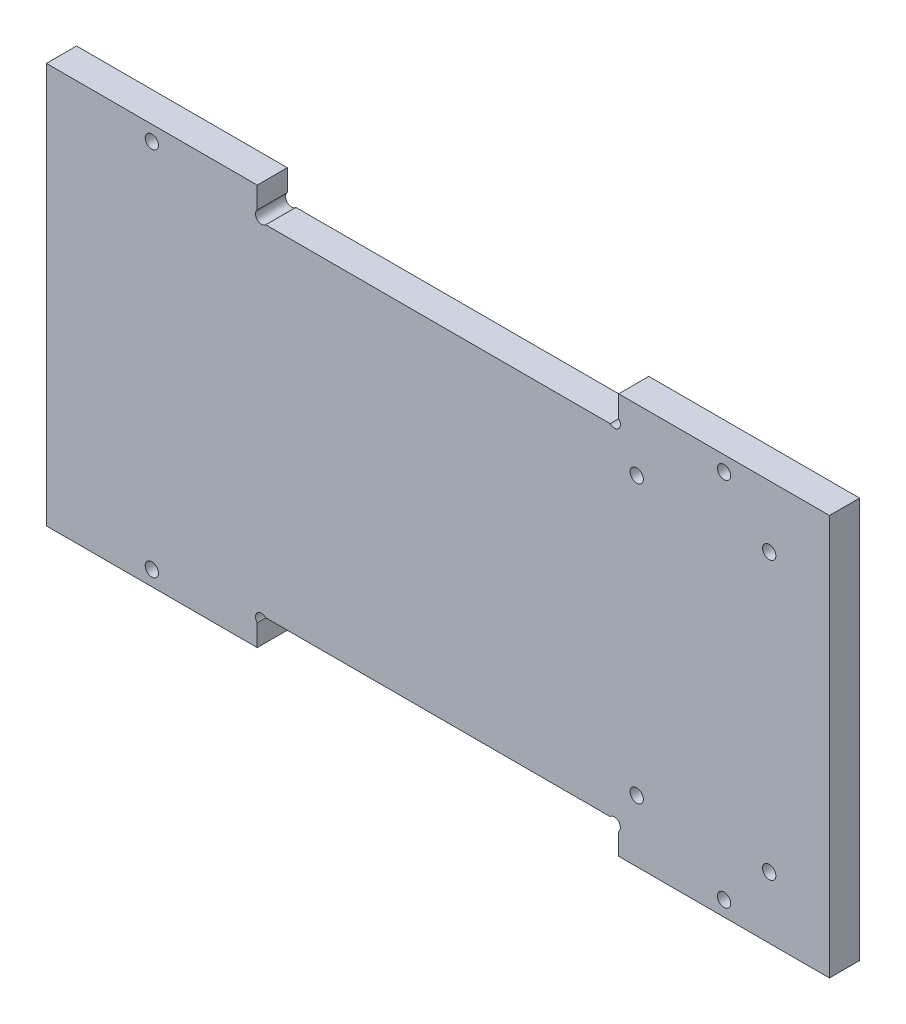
from build123d import *

# Parameters (mm, degrees)
ESQUISSE1_W               = 130
ESQUISSE1_H               = 66.5
BOSS_EXTRU_1_DEPTH        = 5
ENL_V_MAT_EXTRU_2_REACH   = 148.107
ESQUISSE3_R               = 1.1
ENL_V_MAT_EXTRU_4_REACH   = 148.107
ESQUISSE6_W               = 60
ESQUISSE6_H               = 5
ENL_V_START               = -5
ESQUISSE7_R               = 1
ENL_V_MAT_EXTRU_5_DEPTH   = 5
ENL_V_MAT_EXTRU_6_REACH   = 148.107
ESQUISSE8_R               = 1.1
SYM_TRIE3_COPY_1_REACH    = 148.107
SYM_TRIE3_COPY_1_SKETCH_R = 1.1


with BuildPart() as part:
    # Esquisse1 → Boss.-Extru.1 (new body)
    with BuildSketch(Plane.XY):
        with Locations((65, 33.25)):
            Rectangle(ESQUISSE1_W, ESQUISSE1_H)
    extrude(amount=BOSS_EXTRU_1_DEPTH)

    # Esquisse3 → Enl_v. mat.-Extru.2 (cut, up to next)
    with BuildSketch(Plane.XY.offset(5), mode=Mode.PRIVATE) as enl_v_mat_extru_2_sk1:
        with Locations((120, 56.25)):
            Circle(ESQUISSE3_R)
    enl_v_mat_extru_2_tool1 = extrude(enl_v_mat_extru_2_sk1.sketch, amount=-ENL_V_MAT_EXTRU_2_REACH, mode=Mode.PRIVATE) & part.part
    # Esquisse3 → Enl_v. mat.-Extru.2 (cut, up to next)
    with BuildSketch(Plane.XY.offset(5), mode=Mode.PRIVATE) as enl_v_mat_extru_2_sk2:
        with Locations((120, 10.25)):
            Circle(ESQUISSE3_R)
    enl_v_mat_extru_2_tool2 = extrude(enl_v_mat_extru_2_sk2.sketch, amount=-ENL_V_MAT_EXTRU_2_REACH, mode=Mode.PRIVATE) & part.part
    # Esquisse3 → Enl_v. mat.-Extru.2 (cut, up to next)
    with BuildSketch(Plane.XY.offset(5), mode=Mode.PRIVATE) as enl_v_mat_extru_2_sk3:
        with Locations((98, 10.25)):
            Circle(ESQUISSE3_R)
    enl_v_mat_extru_2_tool3 = extrude(enl_v_mat_extru_2_sk3.sketch, amount=-ENL_V_MAT_EXTRU_2_REACH, mode=Mode.PRIVATE) & part.part
    # Esquisse3 → Enl_v. mat.-Extru.2 (cut, up to next)
    with BuildSketch(Plane.XY.offset(5), mode=Mode.PRIVATE) as enl_v_mat_extru_2_sk4:
        with Locations((98, 56.25)):
            Circle(ESQUISSE3_R)
    enl_v_mat_extru_2_tool4 = extrude(enl_v_mat_extru_2_sk4.sketch, amount=-ENL_V_MAT_EXTRU_2_REACH, mode=Mode.PRIVATE) & part.part
    add(enl_v_mat_extru_2_tool1.solids().sort_by_distance((120, 56.25, 5))[0], mode=Mode.SUBTRACT)
    add(enl_v_mat_extru_2_tool2.solids().sort_by_distance((120, 10.25, 5))[0], mode=Mode.SUBTRACT)
    add(enl_v_mat_extru_2_tool3.solids().sort_by_distance((98, 10.25, 5))[0], mode=Mode.SUBTRACT)
    add(enl_v_mat_extru_2_tool4.solids().sort_by_distance((98, 56.25, 5))[0], mode=Mode.SUBTRACT)

    # Esquisse6 → Enl_v. mat.-Extru.4 (cut, up to next)
    with BuildSketch(Plane(origin=(0, 0, 0), x_dir=(-1, 0, 0), z_dir=(0, 0, -1)), mode=Mode.PRIVATE) as enl_v_mat_extru_4_sk1:
        with Locations((-65, 2.5)):
            Rectangle(ESQUISSE6_W, ESQUISSE6_H)
    enl_v_mat_extru_4_tool1 = extrude(enl_v_mat_extru_4_sk1.sketch, amount=-ENL_V_MAT_EXTRU_4_REACH, mode=Mode.PRIVATE) & part.part
    enl_v_mat_extru_4 = enl_v_mat_extru_4_tool1.solids().sort_by_distance((65, 2.5, 0))[0]
    add(enl_v_mat_extru_4, mode=Mode.SUBTRACT)

    # Esquisse7 → Enl_v. mat.-Extru.5 (cut)
    with BuildSketch(Plane(origin=(0, 0, 0), x_dir=(-1, 0, 0), z_dir=(0, 0, -1)).offset(ENL_V_START)):
        with Locations((-94.292893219, 4.292893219)):
            Circle(ESQUISSE7_R)
        with Locations((-35.707106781, 4.292893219)):
            Circle(ESQUISSE7_R)
    enl_v_mat_extru_5 = extrude(amount=ENL_V_MAT_EXTRU_5_DEPTH, mode=Mode.SUBTRACT)

    # Sym_trie1: Enl_v. mat.-Extru.4, Enl_v. mat.-Extru.5 across plane
    add(enl_v_mat_extru_4.mirror(Plane(origin=(0, 33.25, 0), x_dir=(0, 0, 1), z_dir=(0, -1, 0))), mode=Mode.SUBTRACT)
    add(enl_v_mat_extru_5.mirror(Plane(origin=(0, 33.25, 0), x_dir=(0, 0, 1), z_dir=(0, -1, 0))), mode=Mode.SUBTRACT)

    # Esquisse8 → Enl_v. mat.-Extru.6 (cut, up to next)
    with BuildSketch(Plane(origin=(0, 0, 0), x_dir=(-1, 0, 0), z_dir=(0, 0, -1)), mode=Mode.PRIVATE) as enl_v_mat_extru_6_sk1:
        with Locations((-112.5, 2.5)):
            Circle(ESQUISSE8_R)
    enl_v_mat_extru_6_tool1 = extrude(enl_v_mat_extru_6_sk1.sketch, amount=-ENL_V_MAT_EXTRU_6_REACH, mode=Mode.PRIVATE) & part.part
    enl_v_mat_extru_6 = enl_v_mat_extru_6_tool1.solids().sort_by_distance((112.5, 2.5, 0))[0]
    add(enl_v_mat_extru_6, mode=Mode.SUBTRACT)

    # Sym_trie2: Enl_v. mat.-Extru.6 across plane
    add(enl_v_mat_extru_6.mirror(Plane.ZY.offset(-65)), mode=Mode.SUBTRACT)

    # Sym_trie3: Enl_v. mat.-Extru.6 across plane
    add(enl_v_mat_extru_6.mirror(Plane(origin=(0, 33.25, 0), x_dir=(0, 0, 1), z_dir=(0, -1, 0))), mode=Mode.SUBTRACT)

    # Sym_trie3 copy 1 sketch → Sym_trie3 copy 1 (cut, up to next)
    with BuildSketch(Plane(origin=(130, 66.5, 0), x_dir=(1, 0, 0), z_dir=(0, 0, -1)), mode=Mode.PRIVATE) as sym_trie3_copy_1_sk1:
        with Locations((-112.5, 2.5)):
            Circle(SYM_TRIE3_COPY_1_SKETCH_R)
    sym_trie3_copy_1_tool1 = extrude(sym_trie3_copy_1_sk1.sketch, amount=-SYM_TRIE3_COPY_1_REACH, mode=Mode.PRIVATE) & part.part
    add(sym_trie3_copy_1_tool1.solids().sort_by_distance((17.5, 64, 0))[0], mode=Mode.SUBTRACT)


solid = part.part
